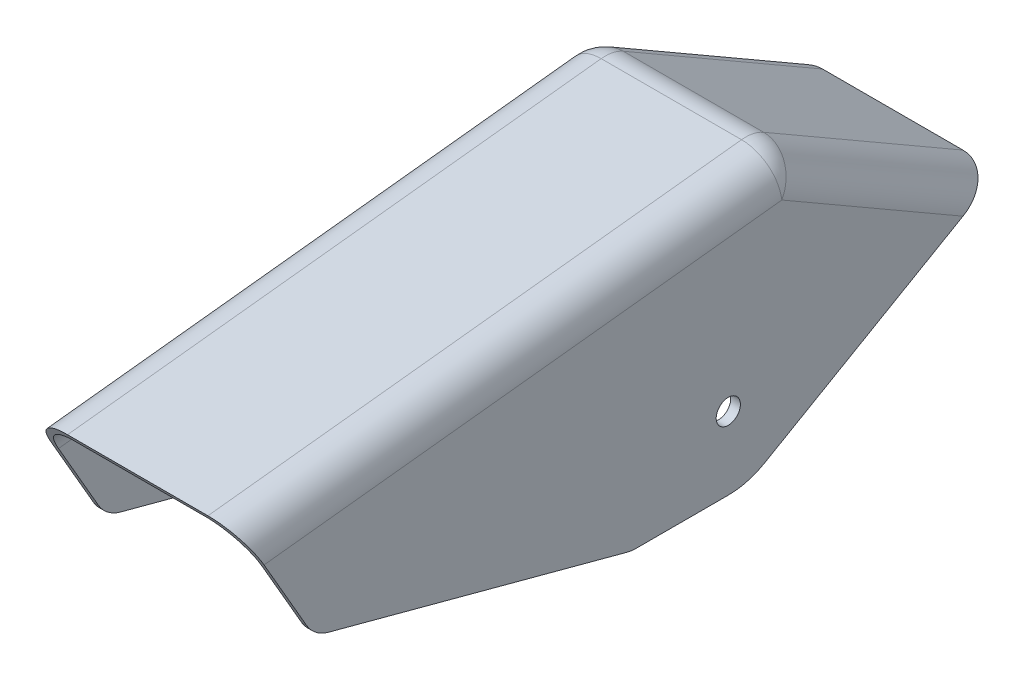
from build123d import *

# Parameters (mm, degrees)
BOSS_EXTRUDE1_START = 200
SKETCH1_R           = 35.00000000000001
SKETCH1_R_2         = 24.999999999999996
BOSS_EXTRUDE1_DEPTH = 10
BOSS_EXTRUDE2_START = -200
SKETCH1_3_R         = 35.00000000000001
SKETCH1_3_R_2       = 24.999999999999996
BOSS_EXTRUDE2_DEPTH = 10
BOSS_EXTRUDE3_START = 210
SKETCH1_4_R         = 35.00000000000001
SKETCH1_4_R_2       = 24.999999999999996
BOSS_EXTRUDE3_DEPTH = 10
BOSS_EXTRUDE4_START = -220
SKETCH1_5_R         = 35.00000000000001
SKETCH1_5_R_2       = 24.999999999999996
BOSS_EXTRUDE4_DEPTH = 10
BOSS_EXTRUDE5_DEPTH = 220
FILLET1_R           = 75
FILLET2_R           = 75


with BuildPart() as part:
    # Sketch1 → Boss-Extrude1 (new body)
    with BuildSketch(Plane(origin=(0, 0, 0), x_dir=(0, 0, -1), z_dir=(1, 0, 0)).offset(BOSS_EXTRUDE1_START)):
        Circle(SKETCH1_R)
        Circle(SKETCH1_R_2, mode=Mode.SUBTRACT)
    extrude(amount=BOSS_EXTRUDE1_DEPTH)

    # Sketch1_4 → Boss-Extrude3 (add)
    # profile 1 of 2: a face of its own
    with BuildSketch(Plane(origin=(0, 0, 0), x_dir=(0, 0, -1), z_dir=(1, 0, 0)).offset(BOSS_EXTRUDE3_START)):
        with BuildLine():
            Line((0, -150), (-200, -150))
            Line((-200, -150), (-855.662432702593, 25.684219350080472))
            Line((-855.662432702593, 25.684219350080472), (-1000, 275.68421935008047))
            Line((-1000, 275.68421935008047), (126.79491924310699, 400))
            Line((126.79491924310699, 400), (559.8076211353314, 150))
            Line((559.8076211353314, 150), (75.00000000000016, -129.90381056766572))
            ThreePointArc((75.00000000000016, -129.90381056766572), (38.82285676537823, -144.8888739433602), (0, -150))
        make_face()
        Circle(SKETCH1_4_R, mode=Mode.SUBTRACT)
    # profile 2 of 2: a face of its own
    with BuildSketch(Plane(origin=(0, 0, 0), x_dir=(0, 0, -1), z_dir=(1, 0, 0)).offset(BOSS_EXTRUDE3_START)):
        Circle(SKETCH1_4_R)
        Circle(SKETCH1_4_R_2, mode=Mode.SUBTRACT)
    extrude(amount=BOSS_EXTRUDE3_DEPTH)



with BuildPart() as body_2:
    # Sketch1_3 → Boss-Extrude2 (new body)
    with BuildSketch(Plane(origin=(0, 0, 0), x_dir=(0, 0, -1), z_dir=(1, 0, 0)).offset(BOSS_EXTRUDE2_START)):
        Circle(SKETCH1_3_R)
        Circle(SKETCH1_3_R_2, mode=Mode.SUBTRACT)
    extrude(amount=-BOSS_EXTRUDE2_DEPTH)

    # Sketch1_5 → Boss-Extrude4 (add)
    # profile 1 of 2: a face of its own
    with BuildSketch(Plane(origin=(0, 0, 0), x_dir=(0, 0, -1), z_dir=(1, 0, 0)).offset(BOSS_EXTRUDE4_START)):
        with BuildLine():
            Line((0, -150), (-200, -150))
            Line((-200, -150), (-855.662432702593, 25.684219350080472))
            Line((-855.662432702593, 25.684219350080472), (-1000, 275.68421935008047))
            Line((-1000, 275.68421935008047), (126.79491924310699, 400))
            Line((126.79491924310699, 400), (559.8076211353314, 150))
            Line((559.8076211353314, 150), (75.00000000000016, -129.90381056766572))
            ThreePointArc((75.00000000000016, -129.90381056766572), (38.82285676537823, -144.8888739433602), (0, -150))
        make_face()
        Circle(SKETCH1_5_R, mode=Mode.SUBTRACT)
    # profile 2 of 2: a face of its own
    with BuildSketch(Plane(origin=(0, 0, 0), x_dir=(0, 0, -1), z_dir=(1, 0, 0)).offset(BOSS_EXTRUDE4_START)):
        Circle(SKETCH1_5_R)
        Circle(SKETCH1_5_R_2, mode=Mode.SUBTRACT)
    extrude(amount=BOSS_EXTRUDE4_DEPTH)


with BuildPart() as part_1:
    add(part.part)

    add(body_2.part)  # Boss-Extrude5 merges body 2
    # Sketch2 → Boss-Extrude5 (add, symmetric)
    with BuildSketch(Plane(origin=(0, 0, 0), x_dir=(0, 0, -1), z_dir=(1, 0, 0))):
        Polygon((559.8076211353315, 149.99999999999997), (126.7949192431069, 399.99999999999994), (-1000, 275.68421935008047), (-994.5392977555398, 266.2260056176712), (124.63354260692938, 389.70086599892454), (549.8076211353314, 144.22649730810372), align=None)
    extrude(amount=BOSS_EXTRUDE5_DEPTH, both=True)

    # Fillet1
    fillet1_edges = [part_1.edges().sort_by_distance(p)[0] for p in [
        (210, 266.9636816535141, -337.2205818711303),
        (210, 327.96343580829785, 434.9528775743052),
        (-210, 327.96343580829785, 434.9528775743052),
        (-210, 266.9636816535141, -337.2205818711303),
    ]]
    fillet(fillet1_edges, radius=FILLET1_R)

    # Fillet2
    fillet2_edges = [part_1.edges().sort_by_distance(p)[0] for p in [
        (220, 275, -343.30127018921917),
        (220, 337.8421096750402, 436.6025403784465),
        (0, 400, -126.79491924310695),
        (215, 25.684219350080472, 855.662432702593),
        (215, -150, 200),
        (-220, 275, -343.30127018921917),
        (-220, 337.8421096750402, 436.6025403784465),
        (-215, 25.684219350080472, 855.662432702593),
        (-215, -150, 200),
    ]]
    fillet(fillet2_edges, radius=FILLET2_R)


solid = part_1.part
